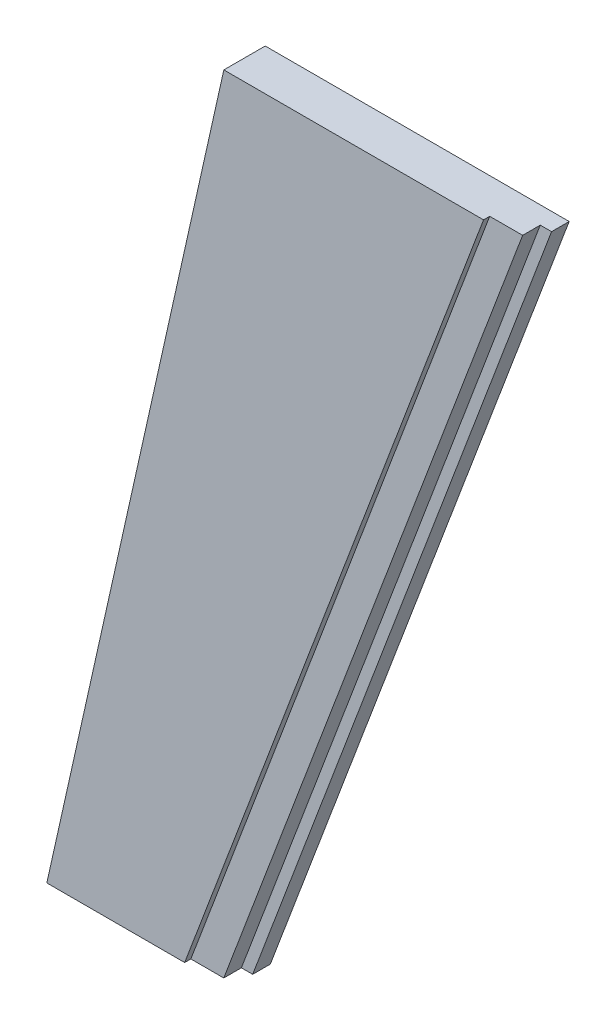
ISO-10303-21;
HEADER;
FILE_DESCRIPTION(('STEP AP214'),'2;1');
FILE_NAME('part.step','',(''),(''),'','','');
FILE_SCHEMA(('AUTOMOTIVE_DESIGN { 1 0 10303 214 1 1 1 1 }'));
ENDSEC;
DATA;
#1=APPLICATION_CONTEXT('core data for automotive mechanical design processes');
#2=APPLICATION_PROTOCOL_DEFINITION('international standard','automotive_design',2000,#1);
#3=PRODUCT_CONTEXT('',#1,'mechanical');
#4=PRODUCT('Part','Part','',(#3));
#5=PRODUCT_RELATED_PRODUCT_CATEGORY('part','',(#4));
#6=PRODUCT_DEFINITION_FORMATION('','',#4);
#7=PRODUCT_DEFINITION_CONTEXT('part definition',#1,'design');
#8=PRODUCT_DEFINITION('design','',#6,#7);
#9=PRODUCT_DEFINITION_SHAPE('','',#8);
#10=(LENGTH_UNIT() NAMED_UNIT(*) SI_UNIT(.MILLI.,.METRE.));
#11=(NAMED_UNIT(*) PLANE_ANGLE_UNIT() SI_UNIT($,.RADIAN.));
#12=(NAMED_UNIT(*) SI_UNIT($,.STERADIAN.) SOLID_ANGLE_UNIT());
#13=UNCERTAINTY_MEASURE_WITH_UNIT(LENGTH_MEASURE(1.E-05),#10,'distance_accuracy_value','');
#14=(GEOMETRIC_REPRESENTATION_CONTEXT(3) GLOBAL_UNCERTAINTY_ASSIGNED_CONTEXT((#13)) GLOBAL_UNIT_ASSIGNED_CONTEXT((#10,
#11,#12)) REPRESENTATION_CONTEXT('',''));
#15=CARTESIAN_POINT('',(0.,0.,0.));
#16=DIRECTION('',(0.,0.,1.));
#17=DIRECTION('',(1.,0.,0.));
#18=AXIS2_PLACEMENT_3D('',#15,#16,#17);
#19=CARTESIAN_POINT('',(-931.84683607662,-1.14114555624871E-13,47.));
#20=DIRECTION('',(-0.935690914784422,0.352820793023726,0.));
#21=DIRECTION('',(-0.352820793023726,-0.935690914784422,0.));
#22=AXIS2_PLACEMENT_3D('',#19,#20,#21);
#23=PLANE('',#22);
#24=DIRECTION('',(0.,0.,-1.));
#25=VECTOR('',#24,1.);
#26=CARTESIAN_POINT('',(-1271.20966273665,-900.000000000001,47.));
#27=LINE('',#26,#25);
#28=CARTESIAN_POINT('',(-1271.20966273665,-900.000000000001,47.));
#29=VERTEX_POINT('',#28);
#30=CARTESIAN_POINT('',(-1271.20966273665,-900.000000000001,40.));
#31=VERTEX_POINT('',#30);
#32=EDGE_CURVE('E49',#29,#31,#27,.T.);
#33=ORIENTED_EDGE('',*,*,#32,.T.);
#34=DIRECTION('',(0.352820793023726,0.935690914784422,0.));
#35=VECTOR('',#34,1.);
#36=CARTESIAN_POINT('',(-931.84683607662,-1.14114555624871E-13,40.));
#37=LINE('',#36,#35);
#38=CARTESIAN_POINT('',(-931.84683607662,-1.14114555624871E-13,40.));
#39=VERTEX_POINT('',#38);
#40=EDGE_CURVE('E45',#31,#39,#37,.T.);
#41=ORIENTED_EDGE('',*,*,#40,.T.);
#42=DIRECTION('',(0.,0.,-1.));
#43=VECTOR('',#42,1.);
#44=CARTESIAN_POINT('',(-931.84683607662,-1.14114555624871E-13,47.));
#45=LINE('',#44,#43);
#46=CARTESIAN_POINT('',(-931.84683607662,-1.14114555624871E-13,47.));
#47=VERTEX_POINT('',#46);
#48=EDGE_CURVE('E11',#47,#39,#45,.T.);
#49=ORIENTED_EDGE('',*,*,#48,.F.);
#50=DIRECTION('',(0.352820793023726,0.935690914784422,0.));
#51=VECTOR('',#50,1.);
#52=CARTESIAN_POINT('',(-931.84683607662,-1.14114555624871E-13,47.));
#53=LINE('',#52,#51);
#54=EDGE_CURVE('E147',#29,#47,#53,.T.);
#55=ORIENTED_EDGE('',*,*,#54,.F.);
#56=EDGE_LOOP('',(#33,#41,#49,#55));
#57=FACE_BOUND('',#56,.T.);
#58=ADVANCED_FACE('F31',(#57),#23,.F.);
#59=CARTESIAN_POINT('',(-931.84683607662,-1.14114555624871E-13,47.));
#60=DIRECTION('',(0.,-1.,0.));
#61=DIRECTION('',(1.,0.,0.));
#62=AXIS2_PLACEMENT_3D('',#59,#60,#61);
#63=PLANE('',#62);
#64=DIRECTION('',(-1.,0.,0.));
#65=VECTOR('',#64,1.);
#66=CARTESIAN_POINT('',(-931.84683607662,-1.14114555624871E-13,0.));
#67=LINE('',#66,#65);
#68=CARTESIAN_POINT('',(-881.616573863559,0.,0.));
#69=VERTEX_POINT('',#68);
#70=CARTESIAN_POINT('',(-1226.73843653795,-1.50227168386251E-13,0.));
#71=VERTEX_POINT('',#70);
#72=EDGE_CURVE('E94',#69,#71,#67,.T.);
#73=ORIENTED_EDGE('',*,*,#72,.T.);
#74=DIRECTION('',(0.,0.,-1.));
#75=VECTOR('',#74,1.);
#76=CARTESIAN_POINT('',(-1226.73843653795,-1.50227168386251E-13,47.));
#77=LINE('',#76,#75);
#78=CARTESIAN_POINT('',(-1226.73843653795,-1.50227168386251E-13,47.));
#79=VERTEX_POINT('',#78);
#80=EDGE_CURVE('E38',#79,#71,#77,.T.);
#81=ORIENTED_EDGE('',*,*,#80,.F.);
#82=DIRECTION('',(-1.,0.,0.));
#83=VECTOR('',#82,1.);
#84=CARTESIAN_POINT('',(-931.84683607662,-1.14114555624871E-13,47.));
#85=LINE('',#84,#83);
#86=EDGE_CURVE('E150',#47,#79,#85,.T.);
#87=ORIENTED_EDGE('',*,*,#86,.F.);
#88=ORIENTED_EDGE('',*,*,#48,.T.);
#89=DIRECTION('',(1.,0.,0.));
#90=VECTOR('',#89,1.);
#91=CARTESIAN_POINT('',(-931.84683607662,-1.14114555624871E-13,40.));
#92=LINE('',#91,#90);
#93=CARTESIAN_POINT('',(-894.441321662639,0.,40.));
#94=VERTEX_POINT('',#93);
#95=EDGE_CURVE('E131',#39,#94,#92,.T.);
#96=ORIENTED_EDGE('',*,*,#95,.T.);
#97=DIRECTION('',(0.,0.,-1.));
#98=VECTOR('',#97,1.);
#99=CARTESIAN_POINT('',(-894.441321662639,0.,40.));
#100=LINE('',#99,#98);
#101=CARTESIAN_POINT('',(-894.441321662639,0.,20.));
#102=VERTEX_POINT('',#101);
#103=EDGE_CURVE('E140',#94,#102,#100,.T.);
#104=ORIENTED_EDGE('',*,*,#103,.T.);
#105=DIRECTION('',(1.,0.,0.));
#106=VECTOR('',#105,1.);
#107=CARTESIAN_POINT('',(-894.441321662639,0.,20.));
#108=LINE('',#107,#106);
#109=CARTESIAN_POINT('',(-881.616573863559,0.,20.));
#110=VERTEX_POINT('',#109);
#111=EDGE_CURVE('E110',#102,#110,#108,.T.);
#112=ORIENTED_EDGE('',*,*,#111,.T.);
#113=DIRECTION('',(0.,0.,-1.));
#114=VECTOR('',#113,1.);
#115=CARTESIAN_POINT('',(-881.616573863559,0.,20.));
#116=LINE('',#115,#114);
#117=EDGE_CURVE('E107',#110,#69,#116,.T.);
#118=ORIENTED_EDGE('',*,*,#117,.T.);
#119=EDGE_LOOP('',(#73,#81,#87,#88,#96,#104,#112,#118));
#120=FACE_BOUND('',#119,.T.);
#121=ADVANCED_FACE('F108',(#120),#63,.F.);
#122=CARTESIAN_POINT('',(-1226.73843653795,-1.50227168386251E-13,47.));
#123=DIRECTION('',(0.975961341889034,-0.217943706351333,0.));
#124=DIRECTION('',(0.217943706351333,0.975961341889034,0.));
#125=AXIS2_PLACEMENT_3D('',#122,#123,#124);
#126=PLANE('',#125);
#127=DIRECTION('',(-0.217943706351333,-0.975961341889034,0.));
#128=VECTOR('',#127,1.);
#129=CARTESIAN_POINT('',(-1226.73843653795,-1.50227168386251E-13,0.));
#130=LINE('',#129,#128);
#131=CARTESIAN_POINT('',(-1427.71907716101,-900.000000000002,0.));
#132=VERTEX_POINT('',#131);
#133=EDGE_CURVE('E100',#71,#132,#130,.T.);
#134=ORIENTED_EDGE('',*,*,#133,.T.);
#135=DIRECTION('',(0.,0.,-1.));
#136=VECTOR('',#135,1.);
#137=CARTESIAN_POINT('',(-1427.71907716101,-900.000000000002,47.));
#138=LINE('',#137,#136);
#139=CARTESIAN_POINT('',(-1427.71907716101,-900.000000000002,47.));
#140=VERTEX_POINT('',#139);
#141=EDGE_CURVE('E157',#140,#132,#138,.T.);
#142=ORIENTED_EDGE('',*,*,#141,.F.);
#143=DIRECTION('',(-0.217943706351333,-0.975961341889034,0.));
#144=VECTOR('',#143,1.);
#145=CARTESIAN_POINT('',(-1226.73843653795,-1.50227168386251E-13,47.));
#146=LINE('',#145,#144);
#147=EDGE_CURVE('E152',#79,#140,#146,.T.);
#148=ORIENTED_EDGE('',*,*,#147,.F.);
#149=ORIENTED_EDGE('',*,*,#80,.T.);
#150=EDGE_LOOP('',(#134,#142,#148,#149));
#151=FACE_BOUND('',#150,.T.);
#152=ADVANCED_FACE('F161',(#151),#126,.F.);
#153=CARTESIAN_POINT('',(-1427.71907716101,-900.000000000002,47.));
#154=DIRECTION('',(0.,1.,0.));
#155=DIRECTION('',(-1.,0.,0.));
#156=AXIS2_PLACEMENT_3D('',#153,#154,#155);
#157=PLANE('',#156);
#158=DIRECTION('',(1.,0.,0.));
#159=VECTOR('',#158,1.);
#160=CARTESIAN_POINT('',(-1427.71907716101,-900.000000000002,0.));
#161=LINE('',#160,#159);
#162=CARTESIAN_POINT('',(-1220.97940052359,-900.000000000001,0.));
#163=VERTEX_POINT('',#162);
#164=EDGE_CURVE('E145',#132,#163,#161,.T.);
#165=ORIENTED_EDGE('',*,*,#164,.T.);
#166=DIRECTION('',(0.,0.,-1.));
#167=VECTOR('',#166,1.);
#168=CARTESIAN_POINT('',(-1220.97940052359,-900.000000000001,20.));
#169=LINE('',#168,#167);
#170=CARTESIAN_POINT('',(-1220.97940052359,-900.000000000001,20.));
#171=VERTEX_POINT('',#170);
#172=EDGE_CURVE('E114',#171,#163,#169,.T.);
#173=ORIENTED_EDGE('',*,*,#172,.F.);
#174=DIRECTION('',(-1.,0.,0.));
#175=VECTOR('',#174,1.);
#176=CARTESIAN_POINT('',(-1233.80414832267,-900.000000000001,20.));
#177=LINE('',#176,#175);
#178=CARTESIAN_POINT('',(-1233.80414832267,-900.000000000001,20.));
#179=VERTEX_POINT('',#178);
#180=EDGE_CURVE('E115',#171,#179,#177,.T.);
#181=ORIENTED_EDGE('',*,*,#180,.T.);
#182=DIRECTION('',(0.,0.,-1.));
#183=VECTOR('',#182,1.);
#184=CARTESIAN_POINT('',(-1233.80414832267,-900.000000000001,40.));
#185=LINE('',#184,#183);
#186=CARTESIAN_POINT('',(-1233.80414832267,-900.000000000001,40.));
#187=VERTEX_POINT('',#186);
#188=EDGE_CURVE('E104',#187,#179,#185,.T.);
#189=ORIENTED_EDGE('',*,*,#188,.F.);
#190=DIRECTION('',(-1.,0.,0.));
#191=VECTOR('',#190,1.);
#192=CARTESIAN_POINT('',(-1271.20966273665,-900.000000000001,40.));
#193=LINE('',#192,#191);
#194=EDGE_CURVE('E137',#187,#31,#193,.T.);
#195=ORIENTED_EDGE('',*,*,#194,.T.);
#196=ORIENTED_EDGE('',*,*,#32,.F.);
#197=DIRECTION('',(1.,0.,0.));
#198=VECTOR('',#197,1.);
#199=CARTESIAN_POINT('',(-1427.71907716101,-900.000000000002,47.));
#200=LINE('',#199,#198);
#201=EDGE_CURVE('E154',#140,#29,#200,.T.);
#202=ORIENTED_EDGE('',*,*,#201,.F.);
#203=ORIENTED_EDGE('',*,*,#141,.T.);
#204=EDGE_LOOP('',(#165,#173,#181,#189,#195,#196,#202,#203));
#205=FACE_BOUND('',#204,.T.);
#206=ADVANCED_FACE('F174',(#205),#157,.F.);
#207=CARTESIAN_POINT('',(-931.84683607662,-1.14114555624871E-13,47.));
#208=DIRECTION('',(0.,0.,-1.));
#209=DIRECTION('',(-1.,0.,0.));
#210=AXIS2_PLACEMENT_3D('',#207,#208,#209);
#211=PLANE('',#210);
#212=ORIENTED_EDGE('',*,*,#54,.T.);
#213=ORIENTED_EDGE('',*,*,#86,.T.);
#214=ORIENTED_EDGE('',*,*,#147,.T.);
#215=ORIENTED_EDGE('',*,*,#201,.T.);
#216=EDGE_LOOP('',(#212,#213,#214,#215));
#217=FACE_BOUND('',#216,.T.);
#218=ADVANCED_FACE('F165',(#217),#211,.F.);
#219=CARTESIAN_POINT('',(-931.84683607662,-1.14114555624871E-13,0.));
#220=DIRECTION('',(0.,0.,-1.));
#221=DIRECTION('',(-1.,0.,0.));
#222=AXIS2_PLACEMENT_3D('',#219,#220,#221);
#223=PLANE('',#222);
#224=ORIENTED_EDGE('',*,*,#72,.F.);
#225=DIRECTION('',(-0.352820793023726,-0.935690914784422,0.));
#226=VECTOR('',#225,1.);
#227=CARTESIAN_POINT('',(-1220.97940052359,-900.000000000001,0.));
#228=LINE('',#227,#226);
#229=EDGE_CURVE('E99',#69,#163,#228,.T.);
#230=ORIENTED_EDGE('',*,*,#229,.T.);
#231=ORIENTED_EDGE('',*,*,#164,.F.);
#232=ORIENTED_EDGE('',*,*,#133,.F.);
#233=EDGE_LOOP('',(#224,#230,#231,#232));
#234=FACE_BOUND('',#233,.T.);
#235=ADVANCED_FACE('F96',(#234),#223,.T.);
#236=CARTESIAN_POINT('',(-1233.80414832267,-900.000000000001,40.));
#237=DIRECTION('',(0.935690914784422,-0.352820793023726,0.));
#238=DIRECTION('',(0.352820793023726,0.935690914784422,0.));
#239=AXIS2_PLACEMENT_3D('',#236,#237,#238);
#240=PLANE('',#239);
#241=DIRECTION('',(0.352820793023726,0.935690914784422,0.));
#242=VECTOR('',#241,1.);
#243=CARTESIAN_POINT('',(-894.441321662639,0.,20.));
#244=LINE('',#243,#242);
#245=EDGE_CURVE('E119',#179,#102,#244,.T.);
#246=ORIENTED_EDGE('',*,*,#245,.T.);
#247=ORIENTED_EDGE('',*,*,#103,.F.);
#248=DIRECTION('',(-0.352820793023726,-0.935690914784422,0.));
#249=VECTOR('',#248,1.);
#250=CARTESIAN_POINT('',(-1233.80414832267,-900.000000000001,40.));
#251=LINE('',#250,#249);
#252=EDGE_CURVE('E134',#94,#187,#251,.T.);
#253=ORIENTED_EDGE('',*,*,#252,.T.);
#254=ORIENTED_EDGE('',*,*,#188,.T.);
#255=EDGE_LOOP('',(#246,#247,#253,#254));
#256=FACE_BOUND('',#255,.T.);
#257=ADVANCED_FACE('F184',(#256),#240,.T.);
#258=CARTESIAN_POINT('',(-1271.20966273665,-900.000000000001,40.));
#259=DIRECTION('',(0.,0.,1.));
#260=DIRECTION('',(1.,0.,0.));
#261=AXIS2_PLACEMENT_3D('',#258,#259,#260);
#262=PLANE('',#261);
#263=ORIENTED_EDGE('',*,*,#40,.F.);
#264=ORIENTED_EDGE('',*,*,#194,.F.);
#265=ORIENTED_EDGE('',*,*,#252,.F.);
#266=ORIENTED_EDGE('',*,*,#95,.F.);
#267=EDGE_LOOP('',(#263,#264,#265,#266));
#268=FACE_BOUND('',#267,.T.);
#269=ADVANCED_FACE('F187',(#268),#262,.T.);
#270=CARTESIAN_POINT('',(-1220.97940052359,-900.000000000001,20.));
#271=DIRECTION('',(0.935690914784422,-0.352820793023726,0.));
#272=DIRECTION('',(0.352820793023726,0.935690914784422,0.));
#273=AXIS2_PLACEMENT_3D('',#270,#271,#272);
#274=PLANE('',#273);
#275=ORIENTED_EDGE('',*,*,#229,.F.);
#276=ORIENTED_EDGE('',*,*,#117,.F.);
#277=DIRECTION('',(-0.352820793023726,-0.935690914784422,0.));
#278=VECTOR('',#277,1.);
#279=CARTESIAN_POINT('',(-1220.97940052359,-900.000000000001,20.));
#280=LINE('',#279,#278);
#281=EDGE_CURVE('E125',#110,#171,#280,.T.);
#282=ORIENTED_EDGE('',*,*,#281,.T.);
#283=ORIENTED_EDGE('',*,*,#172,.T.);
#284=EDGE_LOOP('',(#275,#276,#282,#283));
#285=FACE_BOUND('',#284,.T.);
#286=ADVANCED_FACE('F118',(#285),#274,.T.);
#287=CARTESIAN_POINT('',(-1233.80414832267,-900.000000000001,20.));
#288=DIRECTION('',(0.,0.,1.));
#289=DIRECTION('',(1.,0.,0.));
#290=AXIS2_PLACEMENT_3D('',#287,#288,#289);
#291=PLANE('',#290);
#292=ORIENTED_EDGE('',*,*,#245,.F.);
#293=ORIENTED_EDGE('',*,*,#180,.F.);
#294=ORIENTED_EDGE('',*,*,#281,.F.);
#295=ORIENTED_EDGE('',*,*,#111,.F.);
#296=EDGE_LOOP('',(#292,#293,#294,#295));
#297=FACE_BOUND('',#296,.T.);
#298=ADVANCED_FACE('F194',(#297),#291,.T.);
#299=CLOSED_SHELL('',(#58,#121,#152,#206,#218,#235,#257,#269,#286,#298));
#300=MANIFOLD_SOLID_BREP('B2',#299);
#301=ADVANCED_BREP_SHAPE_REPRESENTATION('',(#18,#300),#14);
#302=SHAPE_DEFINITION_REPRESENTATION(#9,#301);
ENDSEC;
END-ISO-10303-21;
